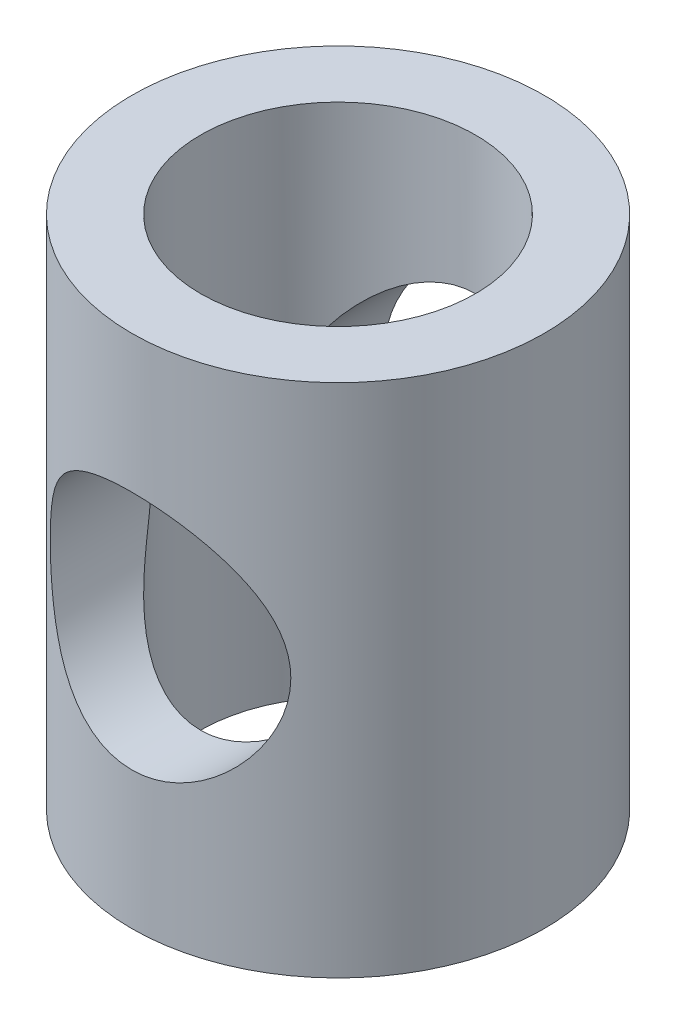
ISO-10303-21;
HEADER;
FILE_DESCRIPTION(('STEP AP214'),'2;1');
FILE_NAME('part.step','',(''),(''),'','','');
FILE_SCHEMA(('AUTOMOTIVE_DESIGN { 1 0 10303 214 1 1 1 1 }'));
ENDSEC;
DATA;
#1=APPLICATION_CONTEXT('core data for automotive mechanical design processes');
#2=APPLICATION_PROTOCOL_DEFINITION('international standard','automotive_design',2000,#1);
#3=PRODUCT_CONTEXT('',#1,'mechanical');
#4=PRODUCT('Part','Part','',(#3));
#5=PRODUCT_RELATED_PRODUCT_CATEGORY('part','',(#4));
#6=PRODUCT_DEFINITION_FORMATION('','',#4);
#7=PRODUCT_DEFINITION_CONTEXT('part definition',#1,'design');
#8=PRODUCT_DEFINITION('design','',#6,#7);
#9=PRODUCT_DEFINITION_SHAPE('','',#8);
#10=(LENGTH_UNIT() NAMED_UNIT(*) SI_UNIT(.MILLI.,.METRE.));
#11=(NAMED_UNIT(*) PLANE_ANGLE_UNIT() SI_UNIT($,.RADIAN.));
#12=(NAMED_UNIT(*) SI_UNIT($,.STERADIAN.) SOLID_ANGLE_UNIT());
#13=UNCERTAINTY_MEASURE_WITH_UNIT(LENGTH_MEASURE(1.E-05),#10,'distance_accuracy_value','');
#14=(GEOMETRIC_REPRESENTATION_CONTEXT(3) GLOBAL_UNCERTAINTY_ASSIGNED_CONTEXT((#13)) GLOBAL_UNIT_ASSIGNED_CONTEXT((#10,
#11,#12)) REPRESENTATION_CONTEXT('',''));
#15=CARTESIAN_POINT('',(0.,0.,0.));
#16=DIRECTION('',(0.,0.,1.));
#17=DIRECTION('',(1.,0.,0.));
#18=AXIS2_PLACEMENT_3D('',#15,#16,#17);
#19=CARTESIAN_POINT('',(0.,75.,0.));
#20=DIRECTION('',(0.,1.,0.));
#21=DIRECTION('',(0.,0.,1.));
#22=AXIS2_PLACEMENT_3D('',#19,#20,#21);
#23=PLANE('',#22);
#24=CARTESIAN_POINT('',(0.,75.,0.));
#25=DIRECTION('',(0.,1.,0.));
#26=DIRECTION('',(0.,0.,1.));
#27=AXIS2_PLACEMENT_3D('',#24,#25,#26);
#28=CIRCLE('',#27,30.);
#29=CARTESIAN_POINT('',(0.,75.,30.));
#30=VERTEX_POINT('',#29);
#31=EDGE_CURVE('E10',#30,#30,#28,.T.);
#32=ORIENTED_EDGE('',*,*,#31,.T.);
#33=EDGE_LOOP('',(#32));
#34=FACE_BOUND('',#33,.T.);
#35=CARTESIAN_POINT('',(0.,75.,0.));
#36=DIRECTION('',(0.,1.,0.));
#37=DIRECTION('',(0.,0.,1.));
#38=AXIS2_PLACEMENT_3D('',#35,#36,#37);
#39=CIRCLE('',#38,20.);
#40=CARTESIAN_POINT('',(0.,75.,20.));
#41=VERTEX_POINT('',#40);
#42=EDGE_CURVE('E46',#41,#41,#39,.T.);
#43=ORIENTED_EDGE('',*,*,#42,.F.);
#44=EDGE_LOOP('',(#43));
#45=FACE_BOUND('',#44,.T.);
#46=ADVANCED_FACE('F28',(#34,#45),#23,.T.);
#47=CARTESIAN_POINT('',(0.,0.,0.));
#48=DIRECTION('',(0.,1.,0.));
#49=DIRECTION('',(0.,0.,1.));
#50=AXIS2_PLACEMENT_3D('',#47,#48,#49);
#51=PLANE('',#50);
#52=CARTESIAN_POINT('',(0.,0.,0.));
#53=DIRECTION('',(0.,1.,0.));
#54=DIRECTION('',(0.,0.,1.));
#55=AXIS2_PLACEMENT_3D('',#52,#53,#54);
#56=CIRCLE('',#55,30.);
#57=CARTESIAN_POINT('',(0.,0.,30.));
#58=VERTEX_POINT('',#57);
#59=EDGE_CURVE('E41',#58,#58,#56,.T.);
#60=ORIENTED_EDGE('',*,*,#59,.F.);
#61=EDGE_LOOP('',(#60));
#62=FACE_BOUND('',#61,.T.);
#63=CARTESIAN_POINT('',(0.,0.,0.));
#64=DIRECTION('',(0.,1.,0.));
#65=DIRECTION('',(0.,0.,1.));
#66=AXIS2_PLACEMENT_3D('',#63,#64,#65);
#67=CIRCLE('',#66,20.);
#68=CARTESIAN_POINT('',(0.,0.,20.));
#69=VERTEX_POINT('',#68);
#70=EDGE_CURVE('E49',#69,#69,#67,.T.);
#71=ORIENTED_EDGE('',*,*,#70,.T.);
#72=EDGE_LOOP('',(#71));
#73=FACE_BOUND('',#72,.T.);
#74=ADVANCED_FACE('F82',(#62,#73),#51,.F.);
#75=CARTESIAN_POINT('',(0.,75.,0.));
#76=DIRECTION('',(0.,-1.,0.));
#77=DIRECTION('',(0.,0.,-1.));
#78=AXIS2_PLACEMENT_3D('',#75,#76,#77);
#79=CYLINDRICAL_SURFACE('',#78,30.);
#80=CARTESIAN_POINT('',(0.,55.,-30.));
#81=CARTESIAN_POINT('',(-0.449810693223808,54.9999968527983,-29.9999971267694));
#82=CARTESIAN_POINT('',(-0.899793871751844,54.9826284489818,-29.9898563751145));
#83=CARTESIAN_POINT('',(-1.79639765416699,54.9133677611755,-29.9495342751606));
#84=CARTESIAN_POINT('',(-2.24301575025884,54.861451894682,-29.919339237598));
#85=CARTESIAN_POINT('',(-3.13036631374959,54.7236137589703,-29.8395660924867));
#86=CARTESIAN_POINT('',(-3.57108144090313,54.6376074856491,-29.789940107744));
#87=CARTESIAN_POINT('',(-4.44222245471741,54.4327162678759,-29.6725435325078));
#88=CARTESIAN_POINT('',(-4.8726500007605,54.3138366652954,-29.6047758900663));
#89=CARTESIAN_POINT('',(-5.71841043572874,54.0452616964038,-29.453072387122));
#90=CARTESIAN_POINT('',(-6.13380743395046,53.8957215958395,-29.3692181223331));
#91=CARTESIAN_POINT('',(-6.94940208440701,53.5670205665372,-29.1869910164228));
#92=CARTESIAN_POINT('',(-7.34959917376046,53.3878585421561,-29.0886176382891));
#93=CARTESIAN_POINT('',(-8.13262843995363,53.0016401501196,-28.8794824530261));
#94=CARTESIAN_POINT('',(-8.51546940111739,52.7945981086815,-28.7687270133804));
#95=CARTESIAN_POINT('',(-9.26243782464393,52.3541334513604,-28.5369970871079));
#96=CARTESIAN_POINT('',(-9.62656342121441,52.1207082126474,-28.4160215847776));
#97=CARTESIAN_POINT('',(-10.3609767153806,51.6107946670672,-28.1569314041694));
#98=CARTESIAN_POINT('',(-10.7297256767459,51.3323977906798,-28.0182109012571));
#99=CARTESIAN_POINT('',(-11.4427112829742,50.7486479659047,-27.7346638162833));
#100=CARTESIAN_POINT('',(-11.7869468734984,50.4432938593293,-27.5898369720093));
#101=CARTESIAN_POINT('',(-12.4500740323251,49.8067916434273,-27.2970177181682));
#102=CARTESIAN_POINT('',(-12.7689355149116,49.4756138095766,-27.1490218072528));
#103=CARTESIAN_POINT('',(-13.3796980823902,48.7891441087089,-26.853283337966));
#104=CARTESIAN_POINT('',(-13.6715977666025,48.4338509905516,-26.7055407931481));
#105=CARTESIAN_POINT('',(-14.259039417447,47.6583817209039,-26.3970089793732));
#106=CARTESIAN_POINT('',(-14.5511698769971,47.2354348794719,-26.2366633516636));
#107=CARTESIAN_POINT('',(-15.0985250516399,46.3628336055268,-25.9255412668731));
#108=CARTESIAN_POINT('',(-15.3537441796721,45.9131751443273,-25.774766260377));
#109=CARTESIAN_POINT('',(-15.8247150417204,44.9897705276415,-25.4883167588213));
#110=CARTESIAN_POINT('',(-16.0405167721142,44.5160558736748,-25.3526232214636));
#111=CARTESIAN_POINT('',(-16.4304876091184,43.5466343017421,-25.1016518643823));
#112=CARTESIAN_POINT('',(-16.6046711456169,43.0509350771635,-24.9863669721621));
#113=CARTESIAN_POINT('',(-16.8738511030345,42.1570607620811,-24.8051015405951));
#114=CARTESIAN_POINT('',(-16.9778465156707,41.7626387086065,-24.7338784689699));
#115=CARTESIAN_POINT('',(-17.1584379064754,40.9648502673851,-24.6089435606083));
#116=CARTESIAN_POINT('',(-17.2350379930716,40.5614852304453,-24.5552290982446));
#117=CARTESIAN_POINT('',(-17.3597911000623,39.7486748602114,-24.4671923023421));
#118=CARTESIAN_POINT('',(-17.4079717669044,39.3392358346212,-24.4328511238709));
#119=CARTESIAN_POINT('',(-17.475309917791,38.5167506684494,-24.3847344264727));
#120=CARTESIAN_POINT('',(-17.4944668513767,38.103704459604,-24.3709592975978));
#121=CARTESIAN_POINT('',(-17.5034683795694,37.2764665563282,-24.3644952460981));
#122=CARTESIAN_POINT('',(-17.4932661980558,36.8622740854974,-24.37183997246));
#123=CARTESIAN_POINT('',(-17.4436068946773,36.036559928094,-24.4074066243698));
#124=CARTESIAN_POINT('',(-17.4041496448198,35.6250382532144,-24.4356286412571));
#125=CARTESIAN_POINT('',(-17.2965326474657,34.807396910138,-24.5119213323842));
#126=CARTESIAN_POINT('',(-17.2283554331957,34.4012806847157,-24.5600040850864));
#127=CARTESIAN_POINT('',(-17.0642171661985,33.597329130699,-24.674328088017));
#128=CARTESIAN_POINT('',(-16.9682554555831,33.1994939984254,-24.7405697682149));
#129=CARTESIAN_POINT('',(-16.7505223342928,32.4173277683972,-24.8884945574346));
#130=CARTESIAN_POINT('',(-16.6289547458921,32.0329164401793,-24.9700552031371));
#131=CARTESIAN_POINT('',(-16.3607241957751,31.2760150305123,-25.1466195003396));
#132=CARTESIAN_POINT('',(-16.2140530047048,30.9035289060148,-25.2416275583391));
#133=CARTESIAN_POINT('',(-15.8968063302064,30.1719347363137,-25.4426176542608));
#134=CARTESIAN_POINT('',(-15.7262290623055,29.8128276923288,-25.5486005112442));
#135=CARTESIAN_POINT('',(-15.3622772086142,29.1090885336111,-25.7690843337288));
#136=CARTESIAN_POINT('',(-15.1689014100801,28.7644571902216,-25.8835857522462));
#137=CARTESIAN_POINT('',(-14.7262927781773,28.0343979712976,-26.1383221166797));
#138=CARTESIAN_POINT('',(-14.4731215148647,27.651739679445,-26.2796660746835));
#139=CARTESIAN_POINT('',(-13.938566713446,26.9086915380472,-26.5670554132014));
#140=CARTESIAN_POINT('',(-13.6571880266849,26.5482978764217,-26.7130999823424));
#141=CARTESIAN_POINT('',(-13.0671312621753,25.8505791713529,-27.0066427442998));
#142=CARTESIAN_POINT('',(-12.758427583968,25.5132762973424,-27.1541421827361));
#143=CARTESIAN_POINT('',(-12.1151118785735,24.8634210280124,-27.4472042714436));
#144=CARTESIAN_POINT('',(-11.7804985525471,24.5508698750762,-27.5927668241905));
#145=CARTESIAN_POINT('',(-11.0433879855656,23.9147479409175,-27.8966228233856));
#146=CARTESIAN_POINT('',(-10.6376217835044,23.594632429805,-28.0542511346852));
#147=CARTESIAN_POINT('',(-9.79663499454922,22.9898586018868,-28.358878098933));
#148=CARTESIAN_POINT('',(-9.36141156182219,22.7052037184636,-28.5058757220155));
#149=CARTESIAN_POINT('',(-8.46396420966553,22.1741060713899,-28.7851006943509));
#150=CARTESIAN_POINT('',(-8.00175196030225,21.9276469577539,-28.9173343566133));
#151=CARTESIAN_POINT('',(-7.0530224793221,21.475616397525,-29.1632455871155));
#152=CARTESIAN_POINT('',(-6.56650828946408,21.2700398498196,-29.2769254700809));
#153=CARTESIAN_POINT('',(-5.60604764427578,20.914870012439,-29.4753513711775));
#154=CARTESIAN_POINT('',(-5.13344287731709,20.7624488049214,-29.5615255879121));
#155=CARTESIAN_POINT('',(-4.17372530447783,20.4977139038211,-29.7122175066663));
#156=CARTESIAN_POINT('',(-3.68661298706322,20.385398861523,-29.776735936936));
#157=CARTESIAN_POINT('',(-2.70250384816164,20.2026964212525,-29.8821207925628));
#158=CARTESIAN_POINT('',(-2.20551623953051,20.1322716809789,-29.9230082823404));
#159=CARTESIAN_POINT('',(-1.20593477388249,20.0343821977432,-29.9799298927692));
#160=CARTESIAN_POINT('',(-0.703341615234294,20.0069121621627,-29.9959670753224));
#161=CARTESIAN_POINT('',(0.238332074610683,19.9961187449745,-30.0022648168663));
#162=CARTESIAN_POINT('',(0.677343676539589,20.0076152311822,-29.9955500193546));
#163=CARTESIAN_POINT('',(1.55252162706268,20.0634898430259,-29.962999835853));
#164=CARTESIAN_POINT('',(1.98868826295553,20.10786459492,-29.9371664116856));
#165=CARTESIAN_POINT('',(2.85498146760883,20.2289147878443,-29.8670045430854));
#166=CARTESIAN_POINT('',(3.28510812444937,20.3055897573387,-29.8226763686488));
#167=CARTESIAN_POINT('',(4.13637468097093,20.490293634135,-29.7165677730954));
#168=CARTESIAN_POINT('',(4.55751432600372,20.5983234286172,-29.654786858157));
#169=CARTESIAN_POINT('',(5.38154043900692,20.8425461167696,-29.5162806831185));
#170=CARTESIAN_POINT('',(5.78461054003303,20.9782647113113,-29.439808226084));
#171=CARTESIAN_POINT('',(6.57727299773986,21.2775169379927,-29.2729147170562));
#172=CARTESIAN_POINT('',(6.96686567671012,21.441049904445,-29.1824939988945));
#173=CARTESIAN_POINT('',(7.73077402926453,21.794514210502,-28.989487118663));
#174=CARTESIAN_POINT('',(8.10508844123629,21.9844477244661,-28.8868999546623));
#175=CARTESIAN_POINT('',(8.83691529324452,22.3892807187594,-28.6714922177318));
#176=CARTESIAN_POINT('',(9.19442574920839,22.6041831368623,-28.5586704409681));
#177=CARTESIAN_POINT('',(9.92769762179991,23.0812082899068,-28.3126392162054));
#178=CARTESIAN_POINT('',(10.3014755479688,23.3459182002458,-28.1785305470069));
#179=CARTESIAN_POINT('',(11.0255438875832,23.9023567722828,-27.9031798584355));
#180=CARTESIAN_POINT('',(11.3758329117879,24.1940870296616,-27.7619374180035));
#181=CARTESIAN_POINT('',(12.0520590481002,24.8033385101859,-27.4751323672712));
#182=CARTESIAN_POINT('',(12.3779693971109,25.1208873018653,-27.3295652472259));
#183=CARTESIAN_POINT('',(13.0038744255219,25.780108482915,-27.0373548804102));
#184=CARTESIAN_POINT('',(13.3038683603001,26.1217815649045,-26.8907116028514));
#185=CARTESIAN_POINT('',(13.9110859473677,26.870283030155,-26.5821575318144));
#186=CARTESIAN_POINT('',(14.2148796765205,27.280015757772,-26.4205194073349));
#187=CARTESIAN_POINT('',(14.7867809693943,28.1265241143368,-26.1047476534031));
#188=CARTESIAN_POINT('',(15.0548831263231,28.5633038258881,-25.9506151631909));
#189=CARTESIAN_POINT('',(15.5530565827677,29.4615959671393,-25.6551405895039));
#190=CARTESIAN_POINT('',(15.7831652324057,29.9230835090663,-25.5137860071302));
#191=CARTESIAN_POINT('',(16.2032645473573,30.8688796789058,-25.2490774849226));
#192=CARTESIAN_POINT('',(16.3932675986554,31.3531812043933,-25.1257179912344));
#193=CARTESIAN_POINT('',(16.6942555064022,32.2350507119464,-24.9264319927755));
#194=CARTESIAN_POINT('',(16.8134449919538,32.6288185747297,-24.8460125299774));
#195=CARTESIAN_POINT('',(17.0243377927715,33.4266604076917,-24.7019890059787));
#196=CARTESIAN_POINT('',(17.1160449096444,33.8307329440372,-24.6383826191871));
#197=CARTESIAN_POINT('',(17.270761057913,34.6464167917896,-24.5301802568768));
#198=CARTESIAN_POINT('',(17.3338004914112,35.0580196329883,-24.4855641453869));
#199=CARTESIAN_POINT('',(17.430437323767,35.8863954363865,-24.4168669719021));
#200=CARTESIAN_POINT('',(17.4640343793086,36.3031684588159,-24.3927861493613));
#201=CARTESIAN_POINT('',(17.5013184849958,37.1398792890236,-24.3660499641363));
#202=CARTESIAN_POINT('',(17.5049242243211,37.559822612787,-24.3634528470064));
#203=CARTESIAN_POINT('',(17.4819549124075,38.398450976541,-24.3799394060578));
#204=CARTESIAN_POINT('',(17.4553797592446,38.8171360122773,-24.3990231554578));
#205=CARTESIAN_POINT('',(17.3724427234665,39.6502522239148,-24.4581439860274));
#206=CARTESIAN_POINT('',(17.3160652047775,40.0646810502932,-24.4981920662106));
#207=CARTESIAN_POINT('',(17.1743332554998,40.8861520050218,-24.5977590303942));
#208=CARTESIAN_POINT('',(17.0889784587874,41.2931940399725,-24.657278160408));
#209=CARTESIAN_POINT('',(16.8933493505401,42.0854422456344,-24.7916997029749));
#210=CARTESIAN_POINT('',(16.7838907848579,42.4709378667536,-24.8660925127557));
#211=CARTESIAN_POINT('',(16.5398304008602,43.2309127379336,-25.0290936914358));
#212=CARTESIAN_POINT('',(16.4052203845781,43.6053883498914,-25.11770669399));
#213=CARTESIAN_POINT('',(16.1120287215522,44.341754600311,-25.3067765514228));
#214=CARTESIAN_POINT('',(15.9534452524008,44.7036442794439,-25.407234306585));
#215=CARTESIAN_POINT('',(15.6134217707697,45.4136605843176,-25.6175920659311));
#216=CARTESIAN_POINT('',(15.4319806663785,45.7617865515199,-25.7274925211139));
#217=CARTESIAN_POINT('',(15.0174007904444,46.4962218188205,-25.9719887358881));
#218=CARTESIAN_POINT('',(14.780608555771,46.8800773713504,-26.1077707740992));
#219=CARTESIAN_POINT('',(14.2793303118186,47.6268432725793,-26.3852759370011));
#220=CARTESIAN_POINT('',(14.01484886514,47.9897570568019,-26.5269980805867));
#221=CARTESIAN_POINT('',(13.4591512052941,48.6938616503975,-26.8132242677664));
#222=CARTESIAN_POINT('',(13.1679135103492,49.0350346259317,-26.9577304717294));
#223=CARTESIAN_POINT('',(12.5600071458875,49.6941478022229,-27.2462739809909));
#224=CARTESIAN_POINT('',(12.2433370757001,50.0120867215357,-27.3903112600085));
#225=CARTESIAN_POINT('',(11.5394613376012,50.6663568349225,-27.6949046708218));
#226=CARTESIAN_POINT('',(11.1485939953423,50.9990058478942,-27.8549417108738));
#227=CARTESIAN_POINT('',(10.3368854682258,51.6302209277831,-28.1662522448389));
#228=CARTESIAN_POINT('',(9.91604087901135,51.9287831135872,-28.3175247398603));
#229=CARTESIAN_POINT('',(9.046247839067,52.4894358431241,-28.6072642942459));
#230=CARTESIAN_POINT('',(8.59728835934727,52.7515119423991,-28.7457262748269));
#231=CARTESIAN_POINT('',(7.67398823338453,53.2363172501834,-29.0058586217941));
#232=CARTESIAN_POINT('',(7.19965138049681,53.4590523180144,-29.1275314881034));
#233=CARTESIAN_POINT('',(6.25177433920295,53.8528613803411,-29.3451946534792));
#234=CARTESIAN_POINT('',(5.77926155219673,54.0258832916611,-29.4421287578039));
#235=CARTESIAN_POINT('',(4.81738564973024,54.3314407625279,-29.6147173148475));
#236=CARTESIAN_POINT('',(4.32801959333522,54.4639692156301,-29.6903680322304));
#237=CARTESIAN_POINT('',(3.3383898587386,54.6860844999,-29.8178345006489));
#238=CARTESIAN_POINT('',(2.83816928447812,54.7758169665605,-29.8697310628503));
#239=CARTESIAN_POINT('',(1.83015669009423,54.9114535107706,-29.948382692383));
#240=CARTESIAN_POINT('',(1.32237185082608,54.9573967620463,-29.975160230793));
#241=CARTESIAN_POINT('',(0.678004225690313,54.9873882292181,-29.9926448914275));
#242=CARTESIAN_POINT('',(0.542466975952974,54.9921161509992,-29.9954016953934));
#243=CARTESIAN_POINT('',(0.271291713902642,54.9984225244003,-29.9990796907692));
#244=CARTESIAN_POINT('',(0.135653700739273,55.0000009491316,-30.0000008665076));
#245=CARTESIAN_POINT('',(0.,55.,-30.));
#246=B_SPLINE_CURVE_WITH_KNOTS('',3,(#80,#81,#82,#83,#84,#85,#86,#87,#88,#89,#90,#91,#92,#93,
#94,#95,#96,#97,#98,#99,#100,#101,#102,#103,#104,#105,#106,#107,#108,#109,#110,#111,#112,#113,
#114,#115,#116,#117,#118,#119,#120,#121,#122,#123,#124,#125,#126,#127,#128,#129,#130,#131,#132,
#133,#134,#135,#136,#137,#138,#139,#140,#141,#142,#143,#144,#145,#146,#147,#148,#149,#150,#151,
#152,#153,#154,#155,#156,#157,#158,#159,#160,#161,#162,#163,#164,#165,#166,#167,#168,#169,#170,
#171,#172,#173,#174,#175,#176,#177,#178,#179,#180,#181,#182,#183,#184,#185,#186,#187,#188,#189,
#190,#191,#192,#193,#194,#195,#196,#197,#198,#199,#200,#201,#202,#203,#204,#205,#206,#207,#208,
#209,#210,#211,#212,#213,#214,#215,#216,#217,#218,#219,#220,#221,#222,#223,#224,#225,#226,#227,
#228,#229,#230,#231,#232,#233,#234,#235,#236,#237,#238,#239,#240,#241,#242,#243,#244,#245),
.UNSPECIFIED.,.T.,.F.,(4,2,2,2,2,2,2,2,2,2,2,2,2,2,2,2,2,2,2,2,2,2,2,2,2,2,2,2,2,2,2,2,2,2,2,2,
2,2,2,2,2,2,2,2,2,2,2,2,2,2,2,2,2,2,2,2,2,2,2,2,2,2,2,2,2,2,2,2,2,2,2,2,2,2,2,2,2,2,2,2,2,2,4),
(0.,1.3492851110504,2.69949220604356,4.05304731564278,5.4063826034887,6.75302671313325,
8.09972064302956,9.44572519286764,10.7918636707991,12.2376383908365,13.6834752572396,
15.1310016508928,16.5786032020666,18.1919933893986,19.8056275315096,21.4172005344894,
23.0282139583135,24.2691750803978,25.509950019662,26.7495159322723,27.9891053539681,
29.2306708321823,30.4722417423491,31.7145688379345,32.9569253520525,34.1897431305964,
35.4229658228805,36.6562806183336,37.8896610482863,39.3285368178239,40.7671655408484,
42.2071566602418,43.6472200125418,45.2661955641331,46.8853277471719,48.503764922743,
50.1220000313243,51.6318206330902,53.1415904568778,54.6500124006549,56.1582484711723,
57.474265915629,58.7901483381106,60.106011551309,61.4219120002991,62.7169231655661,
64.0119033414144,65.306990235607,66.6022296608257,68.0325140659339,69.462882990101,
70.8947998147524,72.3267577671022,73.9300541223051,75.5335930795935,77.1355461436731,
78.7370037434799,79.9933457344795,81.249513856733,82.5043466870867,83.7591941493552,
85.0174425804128,86.2756952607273,87.5346087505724,88.7935381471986,90.015062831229,
91.2369863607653,92.4590028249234,93.6810776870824,95.0927219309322,96.5041339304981,
97.9166891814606,99.3293222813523,100.940233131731,102.551327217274,104.163057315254,
105.774547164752,107.309672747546,108.845067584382,110.375199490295,111.903961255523,
112.310874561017,112.717791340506),.UNSPECIFIED.);
#247=CARTESIAN_POINT('',(0.,55.,-30.));
#248=VERTEX_POINT('',#247);
#249=EDGE_CURVE('E72',#248,#248,#246,.T.);
#250=ORIENTED_EDGE('',*,*,#249,.T.);
#251=EDGE_LOOP('',(#250));
#252=FACE_BOUND('',#251,.T.);
#253=CARTESIAN_POINT('',(17.5,37.5,24.3669858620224));
#254=CARTESIAN_POINT('',(17.5000000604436,37.056792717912,24.3669858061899));
#255=CARTESIAN_POINT('',(17.4831377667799,36.6135858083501,24.3791226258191));
#256=CARTESIAN_POINT('',(17.4159868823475,35.7310236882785,24.4271382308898));
#257=CARTESIAN_POINT('',(17.365697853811,35.2916685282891,24.4630173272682));
#258=CARTESIAN_POINT('',(17.2324735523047,34.4199918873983,24.5570452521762));
#259=CARTESIAN_POINT('',(17.1495094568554,33.9876769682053,24.615213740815));
#260=CARTESIAN_POINT('',(16.9521709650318,33.1335291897,24.7515300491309));
#261=CARTESIAN_POINT('',(16.8377956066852,32.711696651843,24.8296784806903));
#262=CARTESIAN_POINT('',(16.5800092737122,31.8839616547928,25.0025432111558));
#263=CARTESIAN_POINT('',(16.4368106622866,31.4779672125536,25.097137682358));
#264=CARTESIAN_POINT('',(16.122278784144,30.6804715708,25.3003393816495));
#265=CARTESIAN_POINT('',(15.9509327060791,30.2889770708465,25.4089529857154));
#266=CARTESIAN_POINT('',(15.581570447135,29.5221702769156,25.6371168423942));
#267=CARTESIAN_POINT('',(15.3835564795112,29.1468566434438,25.7566661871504));
#268=CARTESIAN_POINT('',(14.9621080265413,28.4135147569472,26.0037496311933));
#269=CARTESIAN_POINT('',(14.7386708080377,28.0554883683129,26.1312845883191));
#270=CARTESIAN_POINT('',(14.2404421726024,27.3176588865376,26.4064348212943));
#271=CARTESIAN_POINT('',(13.9626999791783,26.9400783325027,26.5546739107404));
#272=CARTESIAN_POINT('',(13.3784249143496,26.2089974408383,26.8537794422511));
#273=CARTESIAN_POINT('',(13.0718904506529,25.8554984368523,27.0046460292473));
#274=CARTESIAN_POINT('',(12.431089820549,25.1737277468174,27.3055555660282));
#275=CARTESIAN_POINT('',(12.0968058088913,24.8454725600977,27.4555979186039));
#276=CARTESIAN_POINT('',(11.401920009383,24.2159483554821,27.7513752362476));
#277=CARTESIAN_POINT('',(11.0413169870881,23.91468060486,27.8971099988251));
#278=CARTESIAN_POINT('',(10.2576361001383,23.312008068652,28.195279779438));
#279=CARTESIAN_POINT('',(9.83192059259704,23.0136257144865,28.3469187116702));
#280=CARTESIAN_POINT('',(8.95228757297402,22.4541287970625,28.6368818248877));
#281=CARTESIAN_POINT('',(8.4983676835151,22.1930173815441,28.7752048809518));
#282=CARTESIAN_POINT('',(7.56526903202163,21.7110089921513,29.0344792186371));
#283=CARTESIAN_POINT('',(7.08610713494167,21.4900855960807,29.1554419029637));
#284=CARTESIAN_POINT('',(6.1056098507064,21.0911142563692,29.3764178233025));
#285=CARTESIAN_POINT('',(5.60427787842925,20.9130597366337,29.4764342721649));
#286=CARTESIAN_POINT('',(4.63019809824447,20.616686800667,29.6442704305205));
#287=CARTESIAN_POINT('',(4.15901978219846,20.4943985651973,29.7141960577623));
#288=CARTESIAN_POINT('',(3.20545821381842,20.289165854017,29.8321259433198));
#289=CARTESIAN_POINT('',(2.72307558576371,20.2062191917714,29.8801314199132));
#290=CARTESIAN_POINT('',(1.75166695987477,20.0810068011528,29.9527749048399));
#291=CARTESIAN_POINT('',(1.26264607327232,20.038711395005,29.9774299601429));
#292=CARTESIAN_POINT('',(0.282176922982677,19.9953977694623,30.0026794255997));
#293=CARTESIAN_POINT('',(-0.209271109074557,19.9943756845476,30.0032760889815));
#294=CARTESIAN_POINT('',(-1.1322303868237,20.0312954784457,29.9817525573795));
#295=CARTESIAN_POINT('',(-1.56399587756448,20.0646709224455,29.9622946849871));
#296=CARTESIAN_POINT('',(-2.42263724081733,20.1631166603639,29.9051151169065));
#297=CARTESIAN_POINT('',(-2.8495135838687,20.2281838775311,29.8673951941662));
#298=CARTESIAN_POINT('',(-3.6954666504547,20.389215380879,29.7745634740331));
#299=CARTESIAN_POINT('',(-4.11454310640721,20.4851807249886,29.7194510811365));
#300=CARTESIAN_POINT('',(-4.94223813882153,20.7069102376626,29.5930662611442));
#301=CARTESIAN_POINT('',(-5.35085629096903,20.832675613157,29.5217931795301));
#302=CARTESIAN_POINT('',(-6.15833772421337,21.1137547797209,29.3640154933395));
#303=CARTESIAN_POINT('',(-6.55710361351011,21.2692852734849,29.2773995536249));
#304=CARTESIAN_POINT('',(-7.33960770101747,21.6078036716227,29.0910972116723));
#305=CARTESIAN_POINT('',(-7.72334601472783,21.7907913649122,28.9914109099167));
#306=CARTESIAN_POINT('',(-8.4741739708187,22.1827627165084,28.780903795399));
#307=CARTESIAN_POINT('',(-8.84126121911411,22.3917500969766,28.67008138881));
#308=CARTESIAN_POINT('',(-9.55736888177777,22.8342610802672,28.4393785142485));
#309=CARTESIAN_POINT('',(-9.90638747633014,23.0677871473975,28.3194971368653));
#310=CARTESIAN_POINT('',(-10.6244969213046,23.5863994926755,28.0585529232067));
#311=CARTESIAN_POINT('',(-10.9912325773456,23.8743249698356,27.9166447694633));
#312=CARTESIAN_POINT('',(-11.6993773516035,24.4772938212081,27.6273577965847));
#313=CARTESIAN_POINT('',(-12.0407847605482,24.7923390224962,27.4799786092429));
#314=CARTESIAN_POINT('',(-12.6974279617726,25.4484034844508,27.1828134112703));
#315=CARTESIAN_POINT('',(-13.0126317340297,25.7894535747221,27.0330247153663));
#316=CARTESIAN_POINT('',(-13.6151935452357,26.4958172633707,26.7346135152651));
#317=CARTESIAN_POINT('',(-13.9025503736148,26.861131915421,26.5859910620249));
#318=CARTESIAN_POINT('',(-14.4771819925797,27.6548928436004,26.2779084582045));
#319=CARTESIAN_POINT('',(-14.7611902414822,28.0859194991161,26.1189793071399));
#320=CARTESIAN_POINT('',(-15.2915507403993,28.9743826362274,25.8120591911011));
#321=CARTESIAN_POINT('',(-15.5378973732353,29.431823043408,25.6640698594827));
#322=CARTESIAN_POINT('',(-15.9902353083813,30.3702543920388,25.3846994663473));
#323=CARTESIAN_POINT('',(-16.1962862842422,30.8512091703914,25.2532939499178));
#324=CARTESIAN_POINT('',(-16.5658392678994,31.8344443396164,25.0124312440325));
#325=CARTESIAN_POINT('',(-16.7293569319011,32.3367168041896,24.9029659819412));
#326=CARTESIAN_POINT('',(-16.9778218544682,33.2376897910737,24.7339935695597));
#327=CARTESIAN_POINT('',(-17.0722055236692,33.6327435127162,24.6687946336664));
#328=CARTESIAN_POINT('',(-17.2335829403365,34.4309117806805,24.556329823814));
#329=CARTESIAN_POINT('',(-17.3005809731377,34.8340250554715,24.5090611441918));
#330=CARTESIAN_POINT('',(-17.4062542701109,35.6454011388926,24.4341261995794));
#331=CARTESIAN_POINT('',(-17.4449545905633,36.0536590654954,24.4064425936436));
#332=CARTESIAN_POINT('',(-17.4935678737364,36.8727816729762,24.371622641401));
#333=CARTESIAN_POINT('',(-17.5034801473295,37.2836464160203,24.3644867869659));
#334=CARTESIAN_POINT('',(-17.494359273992,38.1052442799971,24.3710365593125));
#335=CARTESIAN_POINT('',(-17.4753008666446,38.515976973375,24.384740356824));
#336=CARTESIAN_POINT('',(-17.4084809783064,39.3338939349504,24.4324877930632));
#337=CARTESIAN_POINT('',(-17.3607193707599,39.7410781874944,24.466531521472));
#338=CARTESIAN_POINT('',(-17.2371360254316,40.5493284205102,24.5537540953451));
#339=CARTESIAN_POINT('',(-17.1612964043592,40.9503903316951,24.606945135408));
#340=CARTESIAN_POINT('',(-16.9825350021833,41.7436838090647,24.730654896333));
#341=CARTESIAN_POINT('',(-16.8796124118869,42.1359151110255,24.801174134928));
#342=CARTESIAN_POINT('',(-16.6470304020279,42.9121807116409,24.9578875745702));
#343=CARTESIAN_POINT('',(-16.5171914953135,43.2961398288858,25.0441865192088));
#344=CARTESIAN_POINT('',(-16.2323818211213,44.0515501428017,25.229717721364));
#345=CARTESIAN_POINT('',(-16.0774008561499,44.4229961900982,25.3289552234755));
#346=CARTESIAN_POINT('',(-15.7435235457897,45.15194018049,25.5378194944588));
#347=CARTESIAN_POINT('',(-15.5646265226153,45.5094377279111,25.647446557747));
#348=CARTESIAN_POINT('',(-15.1840021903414,46.2094687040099,25.8746053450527));
#349=CARTESIAN_POINT('',(-14.9822722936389,46.5520004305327,25.992137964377));
#350=CARTESIAN_POINT('',(-14.5202953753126,47.2789095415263,26.2534385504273));
#351=CARTESIAN_POINT('',(-14.2559555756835,47.6603218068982,26.39823646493));
#352=CARTESIAN_POINT('',(-13.6986524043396,48.4000650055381,26.6916862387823));
#353=CARTESIAN_POINT('',(-13.4056864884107,48.7583938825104,26.8403384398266));
#354=CARTESIAN_POINT('',(-12.7921419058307,49.450953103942,27.1381182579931));
#355=CARTESIAN_POINT('',(-12.4715408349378,49.7851634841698,27.2872461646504));
#356=CARTESIAN_POINT('',(-11.8041332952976,50.4277626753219,27.5825237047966));
#357=CARTESIAN_POINT('',(-11.4573256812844,50.7361503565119,27.7286732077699));
#358=CARTESIAN_POINT('',(-10.6984420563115,51.3585845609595,28.0308445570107));
#359=CARTESIAN_POINT('',(-10.2834072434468,51.6693918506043,28.1861371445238));
#360=CARTESIAN_POINT('',(-9.42437405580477,52.2547046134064,28.4848726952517));
#361=CARTESIAN_POINT('',(-8.98037302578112,52.5292067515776,28.628314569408));
#362=CARTESIAN_POINT('',(-8.06608814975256,53.0390473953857,28.899228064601));
#363=CARTESIAN_POINT('',(-7.59581924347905,53.2744078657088,29.0267086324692));
#364=CARTESIAN_POINT('',(-6.6318554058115,53.7032917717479,29.2619975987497));
#365=CARTESIAN_POINT('',(-6.13816373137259,53.8968210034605,29.3698087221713));
#366=CARTESIAN_POINT('',(-5.17068943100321,54.2258536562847,29.554816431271));
#367=CARTESIAN_POINT('',(-4.6983821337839,54.364717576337,29.6337509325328));
#368=CARTESIAN_POINT('',(-3.74074104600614,54.6026373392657,29.7697944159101));
#369=CARTESIAN_POINT('',(-3.25540782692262,54.7016949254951,29.8269043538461));
#370=CARTESIAN_POINT('',(-2.27632374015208,54.8583968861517,29.9175510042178));
#371=CARTESIAN_POINT('',(-1.78258009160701,54.9160751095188,29.9511069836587));
#372=CARTESIAN_POINT('',(-0.790940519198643,54.9891822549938,29.9936758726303));
#373=CARTESIAN_POINT('',(-0.293045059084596,55.0046158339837,30.0026914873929));
#374=CARTESIAN_POINT('',(0.640488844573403,54.9937132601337,29.9963337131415));
#375=CARTESIAN_POINT('',(1.07621468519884,54.9723048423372,29.9838375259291));
#376=CARTESIAN_POINT('',(1.9438839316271,54.8971517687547,29.9401059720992));
#377=CARTESIAN_POINT('',(2.37582771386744,54.8434103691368,29.9088724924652));
#378=CARTESIAN_POINT('',(3.23286747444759,54.704274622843,29.8284068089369));
#379=CARTESIAN_POINT('',(3.65796338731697,54.6188799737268,29.7791744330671));
#380=CARTESIAN_POINT('',(4.4984918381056,54.4174570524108,29.6638422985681));
#381=CARTESIAN_POINT('',(4.91392404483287,54.3014277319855,29.5977419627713));
#382=CARTESIAN_POINT('',(5.73041444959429,54.0407087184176,29.4505269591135));
#383=CARTESIAN_POINT('',(6.13153763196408,53.8961756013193,29.3694944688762));
#384=CARTESIAN_POINT('',(6.91961449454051,53.5794680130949,29.1938680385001));
#385=CARTESIAN_POINT('',(7.30656841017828,53.4072940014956,29.0992743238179));
#386=CARTESIAN_POINT('',(8.06459215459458,53.0367423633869,28.8983758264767));
#387=CARTESIAN_POINT('',(8.43566012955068,52.8383616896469,28.7920696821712));
#388=CARTESIAN_POINT('',(9.16043189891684,52.4168452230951,28.5697429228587));
#389=CARTESIAN_POINT('',(9.5141339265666,52.1937069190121,28.4537213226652));
#390=CARTESIAN_POINT('',(10.2407719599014,51.6982606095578,28.2008927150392));
#391=CARTESIAN_POINT('',(10.6115554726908,51.4232439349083,28.0632022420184));
#392=CARTESIAN_POINT('',(11.3288211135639,50.846150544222,27.7814024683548));
#393=CARTESIAN_POINT('',(11.675301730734,50.5440721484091,27.6372927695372));
#394=CARTESIAN_POINT('',(12.3430975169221,49.9140601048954,27.3455818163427));
#395=CARTESIAN_POINT('',(12.6643847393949,49.5860985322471,27.1979769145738));
#396=CARTESIAN_POINT('',(13.2802074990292,48.905988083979,26.9026527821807));
#397=CARTESIAN_POINT('',(13.5747417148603,48.5538380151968,26.7549335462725));
#398=CARTESIAN_POINT('',(14.1679296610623,47.7850218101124,26.4460578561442));
#399=CARTESIAN_POINT('',(14.4632062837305,47.3655821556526,26.2852954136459));
#400=CARTESIAN_POINT('',(15.0171807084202,46.4999096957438,25.9727832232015));
#401=CARTESIAN_POINT('',(15.2758735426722,46.0536732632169,25.8210347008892));
#402=CARTESIAN_POINT('',(15.7542372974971,45.1368246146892,25.5319809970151));
#403=CARTESIAN_POINT('',(15.9739459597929,44.6662365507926,25.3946618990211));
#404=CARTESIAN_POINT('',(16.3721323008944,43.7028031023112,25.1397938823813));
#405=CARTESIAN_POINT('',(16.5506211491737,43.2099637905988,25.0222396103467));
#406=CARTESIAN_POINT('',(16.8367766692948,42.2919343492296,24.8303703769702));
#407=CARTESIAN_POINT('',(16.9513469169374,41.8697167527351,24.7520952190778));
#408=CARTESIAN_POINT('',(17.1490120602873,41.0147944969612,24.6155613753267));
#409=CARTESIAN_POINT('',(17.2321110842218,40.5820912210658,24.5573000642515));
#410=CARTESIAN_POINT('',(17.3655248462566,39.7097504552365,24.4631404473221));
#411=CARTESIAN_POINT('',(17.4158778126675,39.270121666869,24.4272160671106));
#412=CARTESIAN_POINT('',(17.4831154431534,38.386995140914,24.3791387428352));
#413=CARTESIAN_POINT('',(17.4999999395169,37.9434973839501,24.3669859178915));
#414=CARTESIAN_POINT('',(17.5,37.5,24.3669858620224));
#415=B_SPLINE_CURVE_WITH_KNOTS('',3,(#253,#254,#255,#256,#257,#258,#259,#260,#261,#262,#263,
#264,#265,#266,#267,#268,#269,#270,#271,#272,#273,#274,#275,#276,#277,#278,#279,#280,#281,#282,
#283,#284,#285,#286,#287,#288,#289,#290,#291,#292,#293,#294,#295,#296,#297,#298,#299,#300,#301,
#302,#303,#304,#305,#306,#307,#308,#309,#310,#311,#312,#313,#314,#315,#316,#317,#318,#319,#320,
#321,#322,#323,#324,#325,#326,#327,#328,#329,#330,#331,#332,#333,#334,#335,#336,#337,#338,#339,
#340,#341,#342,#343,#344,#345,#346,#347,#348,#349,#350,#351,#352,#353,#354,#355,#356,#357,#358,
#359,#360,#361,#362,#363,#364,#365,#366,#367,#368,#369,#370,#371,#372,#373,#374,#375,#376,#377,
#378,#379,#380,#381,#382,#383,#384,#385,#386,#387,#388,#389,#390,#391,#392,#393,#394,#395,#396,
#397,#398,#399,#400,#401,#402,#403,#404,#405,#406,#407,#408,#409,#410,#411,#412,#413,#414),
.UNSPECIFIED.,.T.,.F.,(4,2,2,2,2,2,2,2,2,2,2,2,2,2,2,2,2,2,2,2,2,2,2,2,2,2,2,2,2,2,2,2,2,2,2,2,
2,2,2,2,2,2,2,2,2,2,2,2,2,2,2,2,2,2,2,2,2,2,2,2,2,2,2,2,2,2,2,2,2,2,2,2,2,2,2,2,2,2,2,2,4),(0.,
1.32914158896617,2.65830058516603,3.98863465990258,5.31900948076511,6.63991934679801,
7.96143210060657,9.28283524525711,10.6043805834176,12.0777280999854,13.5511571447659,
15.0255411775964,16.4999944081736,18.1224671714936,19.7450768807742,21.3666158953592,
22.987906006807,24.4611651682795,25.9343424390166,27.4064433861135,28.8784064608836,
30.1773271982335,31.4761218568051,32.7749609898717,34.0738527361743,35.3825878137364,
36.6913128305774,38.0002254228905,39.3092695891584,40.769887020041,42.2306029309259,
43.6930783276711,45.1556172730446,46.7738815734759,48.3923870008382,50.0084771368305,
51.623971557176,52.8568196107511,54.0894746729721,55.3210369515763,56.5526287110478,
57.7852949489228,59.0179666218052,60.2514247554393,61.4849197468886,62.7269211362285,
63.9694275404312,65.2119691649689,66.4546517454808,67.9115510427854,69.368579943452,
70.8268013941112,72.2850866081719,73.9068057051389,75.5286736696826,77.1496284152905,
78.7703584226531,80.2639755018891,81.7575271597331,83.2498556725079,84.7420196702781,
86.0497217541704,87.3572921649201,88.6648750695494,89.9725027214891,91.2731379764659,
92.5737516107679,93.8745166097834,95.1754136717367,96.6191523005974,98.0629806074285,
99.5083885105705,100.953867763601,102.564565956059,104.175482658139,105.784831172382,
107.393743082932,108.725480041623,110.0570422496,111.387047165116,112.717058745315),.UNSPECIFIED.);
#416=CARTESIAN_POINT('',(17.5,37.5,24.3669858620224));
#417=VERTEX_POINT('',#416);
#418=EDGE_CURVE('E68',#417,#417,#415,.T.);
#419=ORIENTED_EDGE('',*,*,#418,.T.);
#420=EDGE_LOOP('',(#419));
#421=FACE_BOUND('',#420,.T.);
#422=ORIENTED_EDGE('',*,*,#31,.F.);
#423=EDGE_LOOP('',(#422));
#424=FACE_BOUND('',#423,.T.);
#425=ORIENTED_EDGE('',*,*,#59,.T.);
#426=EDGE_LOOP('',(#425));
#427=FACE_BOUND('',#426,.T.);
#428=ADVANCED_FACE('F30',(#252,#421,#424,#427),#79,.T.);
#429=CARTESIAN_POINT('',(0.,75.,0.));
#430=DIRECTION('',(0.,-1.,0.));
#431=DIRECTION('',(0.,0.,-1.));
#432=AXIS2_PLACEMENT_3D('',#429,#430,#431);
#433=CYLINDRICAL_SURFACE('',#432,20.);
#434=CARTESIAN_POINT('',(0.,55.,-20.));
#435=CARTESIAN_POINT('',(-0.409310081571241,55.0000043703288,-20.0000043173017));
#436=CARTESIAN_POINT('',(-0.81857181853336,54.9856188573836,-19.9874130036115));
#437=CARTESIAN_POINT('',(-1.63371360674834,54.928365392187,-19.9373449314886));
#438=CARTESIAN_POINT('',(-2.03959248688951,54.8854879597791,-19.8998598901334));
#439=CARTESIAN_POINT('',(-2.84495519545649,54.7719959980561,-19.8007848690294));
#440=CARTESIAN_POINT('',(-3.24443051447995,54.7013473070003,-19.739165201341));
#441=CARTESIAN_POINT('',(-4.03348452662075,54.5336049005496,-19.5931618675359));
#442=CARTESIAN_POINT('',(-4.42306380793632,54.4365127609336,-19.5087795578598));
#443=CARTESIAN_POINT('',(-5.18734779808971,54.2182045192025,-19.3195605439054));
#444=CARTESIAN_POINT('',(-5.5621332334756,54.0971506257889,-19.2148614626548));
#445=CARTESIAN_POINT('',(-6.29757814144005,53.8322776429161,-18.9865422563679));
#446=CARTESIAN_POINT('',(-6.6582377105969,53.688458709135,-18.8629222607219));
#447=CARTESIAN_POINT('',(-7.36399894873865,53.3798571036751,-18.5987498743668));
#448=CARTESIAN_POINT('',(-7.70910095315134,53.215074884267,-18.4581978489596));
#449=CARTESIAN_POINT('',(-8.38281370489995,52.8662745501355,-18.1621555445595));
#450=CARTESIAN_POINT('',(-8.71142079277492,52.6822521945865,-18.0066619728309));
#451=CARTESIAN_POINT('',(-9.47545139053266,52.221904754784,-17.6199703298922));
#452=CARTESIAN_POINT('',(-9.90295999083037,51.9374321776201,-17.3827741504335));
#453=CARTESIAN_POINT('',(-10.7241338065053,51.3384055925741,-16.8885404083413));
#454=CARTESIAN_POINT('',(-11.1177867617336,51.0238407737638,-16.6314957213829));
#455=CARTESIAN_POINT('',(-11.8718925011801,50.3669653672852,-16.101891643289));
#456=CARTESIAN_POINT('',(-12.2322661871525,50.0245921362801,-15.8292976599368));
#457=CARTESIAN_POINT('',(-12.9189520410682,49.3150097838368,-15.2740176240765));
#458=CARTESIAN_POINT('',(-13.245268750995,48.9478039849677,-14.9913329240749));
#459=CARTESIAN_POINT('',(-13.8709259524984,48.1816356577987,-14.4146539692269));
#460=CARTESIAN_POINT('',(-14.1695316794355,47.7821585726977,-14.1205473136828));
#461=CARTESIAN_POINT('',(-14.7319137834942,46.9588254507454,-13.532778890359));
#462=CARTESIAN_POINT('',(-14.9956791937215,46.5349617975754,-13.2391172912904));
#463=CARTESIAN_POINT('',(-15.4875688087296,45.6630494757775,-12.6601412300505));
#464=CARTESIAN_POINT('',(-15.7157616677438,45.2150496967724,-12.3748115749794));
#465=CARTESIAN_POINT('',(-16.1360267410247,44.2923130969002,-11.8215430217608));
#466=CARTESIAN_POINT('',(-16.3281264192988,43.8175969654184,-11.5535910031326));
#467=CARTESIAN_POINT('',(-16.5900333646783,43.0760316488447,-11.171205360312));
#468=CARTESIAN_POINT('',(-16.6739706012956,42.8200131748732,-11.0453363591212));
#469=CARTESIAN_POINT('',(-16.8311299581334,42.2996823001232,-10.8043372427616));
#470=CARTESIAN_POINT('',(-16.9043516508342,42.0353695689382,-10.6892075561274));
#471=CARTESIAN_POINT('',(-17.03927411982,41.4986956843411,-10.4727930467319));
#472=CARTESIAN_POINT('',(-17.1009917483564,41.2263469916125,-10.37148803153));
#473=CARTESIAN_POINT('',(-17.2121601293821,40.6734796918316,-10.1859341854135));
#474=CARTESIAN_POINT('',(-17.2616155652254,40.392964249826,-10.1016788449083));
#475=CARTESIAN_POINT('',(-17.3407113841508,39.868302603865,-9.96518782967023));
#476=CARTESIAN_POINT('',(-17.3722302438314,39.6252065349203,-9.91001953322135));
#477=CARTESIAN_POINT('',(-17.425218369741,39.1347894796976,-9.81655062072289));
#478=CARTESIAN_POINT('',(-17.4466926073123,38.8874706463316,-9.7782416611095));
#479=CARTESIAN_POINT('',(-17.4791148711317,38.3902413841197,-9.72016781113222));
#480=CARTESIAN_POINT('',(-17.4900749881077,38.1403342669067,-9.70038162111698));
#481=CARTESIAN_POINT('',(-17.5012364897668,37.6394869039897,-9.68023037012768));
#482=CARTESIAN_POINT('',(-17.5014379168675,37.3885466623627,-9.67986523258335));
#483=CARTESIAN_POINT('',(-17.4910766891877,36.8876290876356,-9.69857437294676));
#484=CARTESIAN_POINT('',(-17.4805141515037,36.6376517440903,-9.71764843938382));
#485=CARTESIAN_POINT('',(-17.448891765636,36.140501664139,-9.77431406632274));
#486=CARTESIAN_POINT('',(-17.427831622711,35.8933290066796,-9.81190614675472));
#487=CARTESIAN_POINT('',(-17.3756436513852,35.40287442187,-9.90402925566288));
#488=CARTESIAN_POINT('',(-17.344500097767,35.1595991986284,-9.95858673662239));
#489=CARTESIAN_POINT('',(-17.2727255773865,34.6782610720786,-10.0825630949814));
#490=CARTESIAN_POINT('',(-17.2320912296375,34.440200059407,-10.1519872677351));
#491=CARTESIAN_POINT('',(-17.1147438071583,33.8281025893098,-10.3491760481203));
#492=CARTESIAN_POINT('',(-17.0310468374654,33.4585938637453,-10.486883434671));
#493=CARTESIAN_POINT('',(-16.8429306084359,32.7349509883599,-10.786425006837));
#494=CARTESIAN_POINT('',(-16.7384974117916,32.3808273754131,-10.9482754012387));
#495=CARTESIAN_POINT('',(-16.5101165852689,31.686210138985,-11.2897476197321));
#496=CARTESIAN_POINT('',(-16.3861020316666,31.3457684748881,-11.4694295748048));
#497=CARTESIAN_POINT('',(-16.1198996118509,30.6788757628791,-11.8406510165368));
#498=CARTESIAN_POINT('',(-15.9777136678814,30.352423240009,-12.0321892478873));
#499=CARTESIAN_POINT('',(-15.7054064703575,29.7752962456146,-12.3846537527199));
#500=CARTESIAN_POINT('',(-15.578385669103,29.5223137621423,-12.5442188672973));
#501=CARTESIAN_POINT('',(-15.3131866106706,29.0243959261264,-12.8666205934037));
#502=CARTESIAN_POINT('',(-15.1750072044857,28.7794614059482,-13.0294575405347));
#503=CARTESIAN_POINT('',(-14.7437691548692,28.0561244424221,-13.5207600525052));
#504=CARTESIAN_POINT('',(-14.4340769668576,27.5893284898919,-13.8519299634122));
#505=CARTESIAN_POINT('',(-13.7709397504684,26.6868438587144,-14.5113743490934));
#506=CARTESIAN_POINT('',(-13.4175392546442,26.2511242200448,-14.8396514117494));
#507=CARTESIAN_POINT('',(-12.66635234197,25.4115537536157,-15.4857603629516));
#508=CARTESIAN_POINT('',(-12.2685859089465,25.0076887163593,-15.8035968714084));
#509=CARTESIAN_POINT('',(-11.5236983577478,24.3224054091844,-16.3513589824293));
#510=CARTESIAN_POINT('',(-11.1855959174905,24.0340112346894,-16.5848544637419));
#511=CARTESIAN_POINT('',(-10.4825372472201,23.4797739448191,-17.0379355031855));
#512=CARTESIAN_POINT('',(-10.1175816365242,23.2139303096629,-17.2575213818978));
#513=CARTESIAN_POINT('',(-9.36167408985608,22.7075794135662,-17.6789723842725));
#514=CARTESIAN_POINT('',(-8.97075936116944,22.4670371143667,-17.8808619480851));
#515=CARTESIAN_POINT('',(-8.16333251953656,22.013741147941,-18.2636105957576));
#516=CARTESIAN_POINT('',(-7.74682568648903,21.8009817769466,-18.4444739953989));
#517=CARTESIAN_POINT('',(-6.97073127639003,21.443681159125,-18.749625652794));
#518=CARTESIAN_POINT('',(-6.61524010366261,21.293843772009,-18.8781487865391));
#519=CARTESIAN_POINT('',(-5.88978506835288,21.0163360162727,-19.1169080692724));
#520=CARTESIAN_POINT('',(-5.51982420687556,20.8886610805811,-19.2271479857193));
#521=CARTESIAN_POINT('',(-4.76726960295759,20.6572554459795,-19.4274209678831));
#522=CARTESIAN_POINT('',(-4.3846801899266,20.5535166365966,-19.5174608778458));
#523=CARTESIAN_POINT('',(-3.60900842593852,20.3715520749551,-19.6756627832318));
#524=CARTESIAN_POINT('',(-3.21592595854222,20.29332660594,-19.7438245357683));
#525=CARTESIAN_POINT('',(-2.4198710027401,20.1633991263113,-19.8571577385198));
#526=CARTESIAN_POINT('',(-2.016856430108,20.1118433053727,-19.9022024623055));
#527=CARTESIAN_POINT('',(-1.2062187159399,20.0368757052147,-19.9677334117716));
#528=CARTESIAN_POINT('',(-0.7985955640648,20.0134639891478,-19.988219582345));
#529=CARTESIAN_POINT('',(0.0177076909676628,19.9952483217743,-20.0041573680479));
#530=CARTESIAN_POINT('',(0.426387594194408,20.0004393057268,-19.9996134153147));
#531=CARTESIAN_POINT('',(1.24132609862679,20.0393156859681,-19.9656056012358));
#532=CARTESIAN_POINT('',(1.64758483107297,20.0729995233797,-19.9361431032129));
#533=CARTESIAN_POINT('',(2.41934317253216,20.1640701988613,-19.8565863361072));
#534=CARTESIAN_POINT('',(2.7853269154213,20.2191528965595,-19.8084987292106));
#535=CARTESIAN_POINT('',(3.51008378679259,20.3516762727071,-19.6929924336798));
#536=CARTESIAN_POINT('',(3.86885742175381,20.429115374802,-19.6255751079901));
#537=CARTESIAN_POINT('',(4.57722430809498,20.6052593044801,-19.4725540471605));
#538=CARTESIAN_POINT('',(4.92681597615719,20.7039677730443,-19.3869471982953));
#539=CARTESIAN_POINT('',(5.61507990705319,20.9213647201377,-19.1989107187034));
#540=CARTESIAN_POINT('',(5.95375149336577,21.0400544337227,-19.0964800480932));
#541=CARTESIAN_POINT('',(6.64099831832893,21.3045808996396,-18.8689360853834));
#542=CARTESIAN_POINT('',(6.98872904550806,21.4516997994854,-18.7427659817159));
#543=CARTESIAN_POINT('',(7.66901492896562,21.7654346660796,-18.4748446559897));
#544=CARTESIAN_POINT('',(8.00156984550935,21.9320509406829,-18.3330931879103));
#545=CARTESIAN_POINT('',(8.65064537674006,22.2831520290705,-18.0359008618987));
#546=CARTESIAN_POINT('',(8.96716818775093,22.467634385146,-17.8804618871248));
#547=CARTESIAN_POINT('',(9.58375657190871,22.8530261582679,-17.5576982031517));
#548=CARTESIAN_POINT('',(9.88381872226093,23.0539389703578,-17.3903710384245));
#549=CARTESIAN_POINT('',(10.6172602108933,23.5781253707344,-16.9569151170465));
#550=CARTESIAN_POINT('',(11.0398316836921,23.911184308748,-16.6842336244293));
#551=CARTESIAN_POINT('',(11.8463443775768,24.6082011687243,-16.1216034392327));
#552=CARTESIAN_POINT('',(12.2302679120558,24.9721730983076,-15.8316469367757));
#553=CARTESIAN_POINT('',(12.9614454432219,25.7301400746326,-15.2388790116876));
#554=CARTESIAN_POINT('',(13.3085076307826,26.1242753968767,-14.936010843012));
#555=CARTESIAN_POINT('',(13.9640591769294,26.9392914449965,-14.3250058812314));
#556=CARTESIAN_POINT('',(14.27255791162,27.3601656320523,-14.0168703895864));
#557=CARTESIAN_POINT('',(14.8580392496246,28.2385854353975,-13.3949589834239));
#558=CARTESIAN_POINT('',(15.134130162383,28.696753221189,-13.0812170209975));
#559=CARTESIAN_POINT('',(15.5179948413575,29.4059237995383,-12.6187236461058));
#560=CARTESIAN_POINT('',(15.6409672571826,29.6461134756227,-12.4658257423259));
#561=CARTESIAN_POINT('',(15.876607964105,30.1340819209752,-12.1642869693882));
#562=CARTESIAN_POINT('',(15.989277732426,30.3818595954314,-12.0156454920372));
#563=CARTESIAN_POINT('',(16.2033681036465,30.8837471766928,-11.7253223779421));
#564=CARTESIAN_POINT('',(16.3048577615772,31.1378047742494,-11.5836014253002));
#565=CARTESIAN_POINT('',(16.4970763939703,31.6542832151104,-11.3081681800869));
#566=CARTESIAN_POINT('',(16.5878039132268,31.9167051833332,-11.1744569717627));
#567=CARTESIAN_POINT('',(16.7577981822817,32.4498183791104,-10.9178679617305));
#568=CARTESIAN_POINT('',(16.8370854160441,32.7204937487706,-10.7949709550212));
#569=CARTESIAN_POINT('',(16.9836515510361,33.2707465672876,-10.5628789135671));
#570=CARTESIAN_POINT('',(17.050935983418,33.5503198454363,-10.4536775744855));
#571=CARTESIAN_POINT('',(17.1642334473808,34.0792127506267,-10.266419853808));
#572=CARTESIAN_POINT('',(17.2119003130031,34.3273875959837,-10.1861451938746));
#573=CARTESIAN_POINT('',(17.2969865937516,34.8299482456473,-10.040983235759));
#574=CARTESIAN_POINT('',(17.3344071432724,35.0843333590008,-9.9760942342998));
#575=CARTESIAN_POINT('',(17.3982168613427,35.5977006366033,-9.86439037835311));
#576=CARTESIAN_POINT('',(17.4246365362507,35.8566679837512,-9.81752556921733));
#577=CARTESIAN_POINT('',(17.465978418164,36.3783748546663,-9.74378798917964));
#578=CARTESIAN_POINT('',(17.4809010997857,36.6411142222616,-9.71691439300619));
#579=CARTESIAN_POINT('',(17.4989072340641,37.1701839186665,-9.68445177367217));
#580=CARTESIAN_POINT('',(17.5019069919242,37.4365265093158,-9.67901321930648));
#581=CARTESIAN_POINT('',(17.49574827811,37.9685976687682,-9.69014075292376));
#582=CARTESIAN_POINT('',(17.4865899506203,38.2343262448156,-9.70670657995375));
#583=CARTESIAN_POINT('',(17.4563498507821,38.7634120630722,-9.76098352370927));
#584=CARTESIAN_POINT('',(17.4352452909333,39.0267637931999,-9.79873505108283));
#585=CARTESIAN_POINT('',(17.381640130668,39.5487766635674,-9.89350935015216));
#586=CARTESIAN_POINT('',(17.3491375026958,39.8074369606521,-9.95053555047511));
#587=CARTESIAN_POINT('',(17.2608372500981,40.4038019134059,-10.1031491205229));
#588=CARTESIAN_POINT('',(17.2008879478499,40.7392219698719,-10.2052532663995));
#589=CARTESIAN_POINT('',(17.0636267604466,41.3982167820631,-10.4331340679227));
#590=CARTESIAN_POINT('',(16.9863071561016,41.721786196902,-10.5589212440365));
#591=CARTESIAN_POINT('',(16.8154820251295,42.3578090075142,-10.8289035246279));
#592=CARTESIAN_POINT('',(16.721930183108,42.6702274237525,-10.9731509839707));
#593=CARTESIAN_POINT('',(16.5198679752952,43.2834411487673,-11.275059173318));
#594=CARTESIAN_POINT('',(16.4113578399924,43.584236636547,-11.4327196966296));
#595=CARTESIAN_POINT('',(16.1958343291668,44.1347602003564,-11.7356153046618));
#596=CARTESIAN_POINT('',(16.0906207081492,44.3858739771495,-11.8796281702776));
#597=CARTESIAN_POINT('',(15.8698848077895,44.8803829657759,-12.1729410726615));
#598=CARTESIAN_POINT('',(15.7543610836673,45.1237770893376,-12.322241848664));
#599=CARTESIAN_POINT('',(15.3925479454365,45.8431402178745,-12.7757095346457));
#600=CARTESIAN_POINT('',(15.13108062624,46.3081276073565,-13.0853499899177));
#601=CARTESIAN_POINT('',(14.5681708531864,47.2109021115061,-13.709322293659));
#602=CARTESIAN_POINT('',(14.2666741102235,47.6486510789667,-14.0236599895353));
#603=CARTESIAN_POINT('',(13.623933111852,48.4964199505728,-14.648870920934));
#604=CARTESIAN_POINT('',(13.2826986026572,48.9064466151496,-14.9597449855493));
#605=CARTESIAN_POINT('',(12.5471109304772,49.711794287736,-15.5823772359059));
#606=CARTESIAN_POINT('',(12.1512960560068,50.1060673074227,-15.8937705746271));
#607=CARTESIAN_POINT('',(11.3160065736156,50.8609445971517,-16.498909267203));
#608=CARTESIAN_POINT('',(10.8765215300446,51.2215407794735,-16.792650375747));
#609=CARTESIAN_POINT('',(9.95549048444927,51.9036663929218,-17.354491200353));
#610=CARTESIAN_POINT('',(9.47407718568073,52.2253118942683,-17.6226665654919));
#611=CARTESIAN_POINT('',(8.46936230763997,52.8251952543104,-18.1269205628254));
#612=CARTESIAN_POINT('',(7.9460916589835,53.1034647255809,-18.3630225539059));
#613=CARTESIAN_POINT('',(7.05828187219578,53.5179860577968,-18.7168072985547));
#614=CARTESIAN_POINT('',(6.70528556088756,53.6690655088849,-18.846314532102));
#615=CARTESIAN_POINT('',(5.98474515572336,53.9493820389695,-19.0873528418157));
#616=CARTESIAN_POINT('',(5.61720280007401,54.078621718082,-19.1988860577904));
#617=CARTESIAN_POINT('',(4.86992231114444,54.3132965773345,-19.4018938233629));
#618=CARTESIAN_POINT('',(4.49020674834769,54.4187731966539,-19.4934032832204));
#619=CARTESIAN_POINT('',(3.72029279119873,54.6045672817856,-19.6548750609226));
#620=CARTESIAN_POINT('',(3.33009745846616,54.6848920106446,-19.7248435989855));
#621=CARTESIAN_POINT('',(2.45471186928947,54.8338520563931,-19.8547424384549));
#622=CARTESIAN_POINT('',(1.96755125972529,54.8960016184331,-19.9090549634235));
#623=CARTESIAN_POINT('',(0.986904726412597,54.9790781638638,-19.9816856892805));
#624=CARTESIAN_POINT('',(0.493417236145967,54.9999947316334,-19.9999947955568));
#625=CARTESIAN_POINT('',(0.,55.,-20.));
#626=B_SPLINE_CURVE_WITH_KNOTS('',3,(#434,#435,#436,#437,#438,#439,#440,#441,#442,#443,#444,
#445,#446,#447,#448,#449,#450,#451,#452,#453,#454,#455,#456,#457,#458,#459,#460,#461,#462,#463,
#464,#465,#466,#467,#468,#469,#470,#471,#472,#473,#474,#475,#476,#477,#478,#479,#480,#481,#482,
#483,#484,#485,#486,#487,#488,#489,#490,#491,#492,#493,#494,#495,#496,#497,#498,#499,#500,#501,
#502,#503,#504,#505,#506,#507,#508,#509,#510,#511,#512,#513,#514,#515,#516,#517,#518,#519,#520,
#521,#522,#523,#524,#525,#526,#527,#528,#529,#530,#531,#532,#533,#534,#535,#536,#537,#538,#539,
#540,#541,#542,#543,#544,#545,#546,#547,#548,#549,#550,#551,#552,#553,#554,#555,#556,#557,#558,
#559,#560,#561,#562,#563,#564,#565,#566,#567,#568,#569,#570,#571,#572,#573,#574,#575,#576,#577,
#578,#579,#580,#581,#582,#583,#584,#585,#586,#587,#588,#589,#590,#591,#592,#593,#594,#595,#596,
#597,#598,#599,#600,#601,#602,#603,#604,#605,#606,#607,#608,#609,#610,#611,#612,#613,#614,#615,
#616,#617,#618,#619,#620,#621,#622,#623,#624,#625),.UNSPECIFIED.,.T.,.F.,(4,2,2,2,2,2,2,2,2,2,2,
2,2,2,2,2,2,2,2,2,2,2,2,2,2,2,2,2,2,2,2,2,2,2,2,2,2,2,2,2,2,2,2,2,2,2,2,2,2,2,2,2,2,2,2,2,2,2,2,
2,2,2,2,2,2,2,2,2,2,2,2,2,2,2,2,2,2,2,2,2,2,2,2,2,2,2,2,2,2,2,2,2,2,2,2,4),(0.,1.2274053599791,
2.45521932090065,3.68454838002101,4.91380419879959,6.13500687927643,7.35620120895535,
8.57736919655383,9.79880691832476,11.4932530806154,13.1883102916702,14.8872978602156,
16.5860585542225,18.3215055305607,20.057497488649,21.7900963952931,23.5213715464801,
24.4131079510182,25.3048799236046,26.1953350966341,27.0854496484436,27.8385169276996,
28.5912110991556,29.3430386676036,30.0948632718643,30.8466796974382,31.5985172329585,
32.3515329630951,33.1048173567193,34.3121317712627,35.5202604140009,36.732611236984,
37.9448339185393,38.9193800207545,39.8940266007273,41.8438512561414,43.7917054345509,
45.7386857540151,47.2434221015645,48.7481237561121,50.250713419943,51.7529941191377,
52.9717012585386,54.1901569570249,55.4081991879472,56.6262549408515,57.850918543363,
59.0755848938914,60.3000343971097,61.5244169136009,62.6428157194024,63.761135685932,
64.8796472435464,65.9982279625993,67.1913663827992,68.3845236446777,69.5775170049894,
70.7707575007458,72.5777163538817,74.385498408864,76.2022686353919,78.0185962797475,
79.8768433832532,80.8070514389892,81.7371259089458,82.6610887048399,83.5851762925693,
84.5075881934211,85.4295739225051,86.2244123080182,87.0191626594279,87.8116941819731,
88.6041929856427,89.4022451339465,90.2002878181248,90.9998579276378,91.799570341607,
92.8649317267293,93.9307674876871,94.9996959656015,96.068607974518,96.9922887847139,
97.9160992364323,99.7643098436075,101.615053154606,103.465343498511,105.381706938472,
107.298529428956,109.209491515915,111.119054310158,112.333623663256,113.54804831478,
114.76033851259,115.972278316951,117.451523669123,118.931142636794),.UNSPECIFIED.);
#627=CARTESIAN_POINT('',(0.,55.,-20.));
#628=VERTEX_POINT('',#627);
#629=EDGE_CURVE('E33',#628,#628,#626,.T.);
#630=ORIENTED_EDGE('',*,*,#629,.F.);
#631=EDGE_LOOP('',(#630));
#632=FACE_BOUND('',#631,.T.);
#633=CARTESIAN_POINT('',(17.5,37.5,9.68245836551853));
#634=CARTESIAN_POINT('',(17.4999987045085,37.2184149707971,9.68246231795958));
#635=CARTESIAN_POINT('',(17.493183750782,36.9368105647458,9.69480918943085));
#636=CARTESIAN_POINT('',(17.4661432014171,36.3763405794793,9.74343813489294));
#637=CARTESIAN_POINT('',(17.4459158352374,36.0974753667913,9.77972336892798));
#638=CARTESIAN_POINT('',(17.3925802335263,35.5440737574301,9.87426328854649));
#639=CARTESIAN_POINT('',(17.3594395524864,35.2695500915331,9.93257330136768));
#640=CARTESIAN_POINT('',(17.2810764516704,34.7269860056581,10.0682929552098));
#641=CARTESIAN_POINT('',(17.2358485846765,34.4589485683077,10.1457112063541));
#642=CARTESIAN_POINT('',(17.1116158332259,33.8130556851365,10.3543761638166));
#643=CARTESIAN_POINT('',(17.0265244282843,33.4391686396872,10.4942738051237));
#644=CARTESIAN_POINT('',(16.835147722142,32.7071790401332,10.7986160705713));
#645=CARTESIAN_POINT('',(16.7288502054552,32.3490857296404,10.9630748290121));
#646=CARTESIAN_POINT('',(16.4963517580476,31.647007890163,11.3099122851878));
#647=CARTESIAN_POINT('',(16.3700907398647,31.3030700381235,11.4923444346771));
#648=CARTESIAN_POINT('',(16.0989927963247,30.6294660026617,11.8691327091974));
#649=CARTESIAN_POINT('',(15.9541574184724,30.2997986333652,12.063487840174));
#650=CARTESIAN_POINT('',(15.6780399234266,29.7198984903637,12.4192960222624));
#651=CARTESIAN_POINT('',(15.5500516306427,29.4672183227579,12.5793409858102));
#652=CARTESIAN_POINT('',(15.2829019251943,28.9699022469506,12.902593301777));
#653=CARTESIAN_POINT('',(15.1437394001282,28.7252671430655,13.0658009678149));
#654=CARTESIAN_POINT('',(14.7095234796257,28.0028432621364,13.5580665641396));
#655=CARTESIAN_POINT('',(14.397804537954,27.5366672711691,13.889684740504));
#656=CARTESIAN_POINT('',(13.7305135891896,26.6355215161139,14.5496844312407));
#657=CARTESIAN_POINT('',(13.3749876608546,26.2005197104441,14.8780689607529));
#658=CARTESIAN_POINT('',(12.6194286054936,25.3625367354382,15.5240744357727));
#659=CARTESIAN_POINT('',(12.2194155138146,24.9595412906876,15.8417001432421));
#660=CARTESIAN_POINT('',(11.4719737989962,24.2773934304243,16.3876744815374));
#661=CARTESIAN_POINT('',(11.1337109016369,23.9911222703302,16.6197113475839));
#662=CARTESIAN_POINT('',(10.4305290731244,23.4410785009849,17.0698056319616));
#663=CARTESIAN_POINT('',(10.0656108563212,23.1773052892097,17.2878634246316));
#664=CARTESIAN_POINT('',(9.30998224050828,22.6750294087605,17.706227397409));
#665=CARTESIAN_POINT('',(8.91930810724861,22.4364923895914,17.9065576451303));
#666=CARTESIAN_POINT('',(8.11259198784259,21.9871379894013,18.2861816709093));
#667=CARTESIAN_POINT('',(7.69655515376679,21.7763150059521,18.4654796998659));
#668=CARTESIAN_POINT('',(6.92084465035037,21.4221227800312,18.7680937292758));
#669=CARTESIAN_POINT('',(6.56519415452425,21.2735136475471,18.8956068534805));
#670=CARTESIAN_POINT('',(5.8395355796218,20.9984757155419,19.1323128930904));
#671=CARTESIAN_POINT('',(5.46953046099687,20.8720423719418,19.2415095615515));
#672=CARTESIAN_POINT('',(4.71701905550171,20.6431221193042,19.4396771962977));
#673=CARTESIAN_POINT('',(4.33451712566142,20.5406269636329,19.5286551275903));
#674=CARTESIAN_POINT('',(3.55916144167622,20.3611349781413,19.6847333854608));
#675=CARTESIAN_POINT('',(3.16630757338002,20.2841384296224,19.7518334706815));
#676=CARTESIAN_POINT('',(2.37089370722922,20.1566456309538,19.8630552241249));
#677=CARTESIAN_POINT('',(1.96829309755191,20.1062930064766,19.9070523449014));
#678=CARTESIAN_POINT('',(1.15863165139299,20.0336676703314,19.9705396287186));
#679=CARTESIAN_POINT('',(0.751570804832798,20.0113950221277,19.9900297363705));
#680=CARTESIAN_POINT('',(-0.0634815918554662,19.995369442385,20.0040514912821));
#681=CARTESIAN_POINT('',(-0.471472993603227,20.0016122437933,19.9985868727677));
#682=CARTESIAN_POINT('',(-1.28491619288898,20.0424855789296,19.9628332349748));
#683=CARTESIAN_POINT('',(-1.69036812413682,20.077114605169,19.9325455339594));
#684=CARTESIAN_POINT('',(-2.46102432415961,20.1699412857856,19.8514602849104));
#685=CARTESIAN_POINT('',(-2.82671325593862,20.2258782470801,19.8026311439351));
#686=CARTESIAN_POINT('',(-3.55079998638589,20.3600646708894,19.6856876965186));
#687=CARTESIAN_POINT('',(-3.90919828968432,20.4383125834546,19.6175747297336));
#688=CARTESIAN_POINT('',(-4.61671283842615,20.6160125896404,19.4632241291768));
#689=CARTESIAN_POINT('',(-4.96582840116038,20.7154662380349,19.3769851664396));
#690=CARTESIAN_POINT('',(-5.65308969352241,20.934292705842,19.1877471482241));
#691=CARTESIAN_POINT('',(-5.99123474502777,21.053666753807,19.0847470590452));
#692=CARTESIAN_POINT('',(-6.67782328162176,21.3197251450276,18.8559373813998));
#693=CARTESIAN_POINT('',(-7.02540131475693,21.467715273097,18.7290524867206));
#694=CARTESIAN_POINT('',(-7.70531466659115,21.7831743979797,18.4597362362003));
#695=CARTESIAN_POINT('',(-8.03764972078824,21.9506437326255,18.3173046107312));
#696=CARTESIAN_POINT('',(-8.68638320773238,22.3035155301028,18.0187205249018));
#697=CARTESIAN_POINT('',(-9.00277616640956,22.4889240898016,17.8625634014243));
#698=CARTESIAN_POINT('',(-9.6190398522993,22.876164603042,17.5383965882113));
#699=CARTESIAN_POINT('',(-9.91890713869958,23.077999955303,17.3703844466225));
#700=CARTESIAN_POINT('',(-10.6524472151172,23.6049775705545,16.9348626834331));
#701=CARTESIAN_POINT('',(-11.0752167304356,23.9399552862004,16.660790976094));
#702=CARTESIAN_POINT('',(-11.881898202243,24.640906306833,16.0954431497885));
#703=CARTESIAN_POINT('',(-12.265792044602,25.0068939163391,15.8041591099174));
#704=CARTESIAN_POINT('',(-12.9958240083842,25.768103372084,15.2095597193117));
#705=CARTESIAN_POINT('',(-13.3418605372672,26.1633993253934,14.9062148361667));
#706=CARTESIAN_POINT('',(-13.9953365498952,26.9807626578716,14.2944299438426));
#707=CARTESIAN_POINT('',(-14.3027862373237,27.4028229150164,13.9859913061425));
#708=CARTESIAN_POINT('',(-14.8388897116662,28.2124381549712,13.414122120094));
#709=CARTESIAN_POINT('',(-15.0725463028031,28.5965219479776,13.1504504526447));
#710=CARTESIAN_POINT('',(-15.5114180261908,29.3852194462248,12.6297963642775));
#711=CARTESIAN_POINT('',(-15.7166252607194,29.7898388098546,12.3728158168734));
#712=CARTESIAN_POINT('',(-16.0972148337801,30.6197677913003,11.8734123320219));
#713=CARTESIAN_POINT('',(-16.2726794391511,31.045016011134,11.6309504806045));
#714=CARTESIAN_POINT('',(-16.5927788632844,31.9191354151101,11.1695243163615));
#715=CARTESIAN_POINT('',(-16.7374405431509,32.3679855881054,10.950539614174));
#716=CARTESIAN_POINT('',(-16.9333325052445,33.075380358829,10.6432351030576));
#717=CARTESIAN_POINT('',(-16.9966377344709,33.3248622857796,10.5416678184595));
#718=CARTESIAN_POINT('',(-17.1130712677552,33.8311749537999,10.3515787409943));
#719=CARTESIAN_POINT('',(-17.1661983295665,34.088006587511,10.2630585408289));
#720=CARTESIAN_POINT('',(-17.2614241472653,34.6081207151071,10.1020785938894));
#721=CARTESIAN_POINT('',(-17.3035451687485,34.8713889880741,10.0295864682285));
#722=CARTESIAN_POINT('',(-17.3760879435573,35.4038837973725,9.90337736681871));
#723=CARTESIAN_POINT('',(-17.4065160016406,35.6731070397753,9.84965027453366));
#724=CARTESIAN_POINT('',(-17.4552894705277,36.2197187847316,9.76296098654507));
#725=CARTESIAN_POINT('',(-17.4734688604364,36.4971682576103,9.73028436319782));
#726=CARTESIAN_POINT('',(-17.4965474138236,37.0543974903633,9.68872595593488));
#727=CARTESIAN_POINT('',(-17.5014478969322,37.3341770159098,9.67984180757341));
#728=CARTESIAN_POINT('',(-17.4978121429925,37.8934117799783,9.68641226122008));
#729=CARTESIAN_POINT('',(-17.4892733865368,38.1728669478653,9.70187142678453));
#730=CARTESIAN_POINT('',(-17.4590283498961,38.7287654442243,9.75619132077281));
#731=CARTESIAN_POINT('',(-17.4373200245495,39.0052082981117,9.79505568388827));
#732=CARTESIAN_POINT('',(-17.3778033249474,39.5876182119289,9.9003050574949));
#733=CARTESIAN_POINT('',(-17.3383041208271,39.8928904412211,9.96955210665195));
#734=CARTESIAN_POINT('',(-17.2445130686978,40.4949435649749,10.1309144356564));
#735=CARTESIAN_POINT('',(-17.1902178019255,40.7917224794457,10.2230350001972));
#736=CARTESIAN_POINT('',(-17.0678080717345,41.376796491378,10.4261214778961));
#737=CARTESIAN_POINT('',(-16.9996516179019,41.6650626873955,10.5371444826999));
#738=CARTESIAN_POINT('',(-16.8505942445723,42.2321759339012,10.7739055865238));
#739=CARTESIAN_POINT('',(-16.769687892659,42.5110189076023,10.8996499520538));
#740=CARTESIAN_POINT('',(-16.6071825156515,43.0239660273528,11.1454160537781));
#741=CARTESIAN_POINT('',(-16.527027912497,43.2591902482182,11.2640727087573));
#742=CARTESIAN_POINT('',(-16.3580751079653,43.7228796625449,11.5080593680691));
#743=CARTESIAN_POINT('',(-16.2692786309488,43.9513461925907,11.6333880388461));
#744=CARTESIAN_POINT('',(-15.9902069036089,44.6275110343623,12.0172011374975));
#745=CARTESIAN_POINT('',(-15.7873351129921,45.0657068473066,12.2833802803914));
#746=CARTESIAN_POINT('',(-15.3491681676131,45.9192286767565,12.8267404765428));
#747=CARTESIAN_POINT('',(-15.1138270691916,46.3345210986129,13.1039367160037));
#748=CARTESIAN_POINT('',(-14.611432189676,47.1427341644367,13.6618803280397));
#749=CARTESIAN_POINT('',(-14.3443866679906,47.5356605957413,13.9426267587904));
#750=CARTESIAN_POINT('',(-13.7569296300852,48.3285991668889,14.5234398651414));
#751=CARTESIAN_POINT('',(-13.4340017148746,48.7268676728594,14.8233476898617));
#752=CARTESIAN_POINT('',(-12.7509309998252,49.4970273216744,15.4148615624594));
#753=CARTESIAN_POINT('',(-12.3907813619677,49.8689135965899,15.7064660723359));
#754=CARTESIAN_POINT('',(-11.6337204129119,50.5834598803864,16.2751429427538));
#755=CARTESIAN_POINT('',(-11.2368838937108,50.9261767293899,16.5522431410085));
#756=CARTESIAN_POINT('',(-10.4058480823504,51.5800435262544,17.0869029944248));
#757=CARTESIAN_POINT('',(-9.97166247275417,51.8912049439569,17.3444697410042));
#758=CARTESIAN_POINT('',(-9.1830442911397,52.4024200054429,17.7712631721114));
#759=CARTESIAN_POINT('',(-8.83683781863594,52.6104610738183,17.9461673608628));
#760=CARTESIAN_POINT('',(-8.12480400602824,53.0049387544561,18.2795514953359));
#761=CARTESIAN_POINT('',(-7.75898151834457,53.1913806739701,18.4380354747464));
#762=CARTESIAN_POINT('',(-7.00880756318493,53.5405024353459,18.7360469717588));
#763=CARTESIAN_POINT('',(-6.62446045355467,53.7031878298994,18.875578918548));
#764=CARTESIAN_POINT('',(-5.83876634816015,54.002591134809,19.1332092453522));
#765=CARTESIAN_POINT('',(-5.43741906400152,54.139308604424,19.2513072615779));
#766=CARTESIAN_POINT('',(-4.61635990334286,54.3856305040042,19.464600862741));
#767=CARTESIAN_POINT('',(-4.19651630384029,54.4949826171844,19.5595831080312));
#768=CARTESIAN_POINT('',(-3.3448941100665,54.6828922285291,19.7230737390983));
#769=CARTESIAN_POINT('',(-2.91311547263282,54.7614496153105,19.79158202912));
#770=CARTESIAN_POINT('',(-2.04168403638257,54.8860605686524,19.9003562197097));
#771=CARTESIAN_POINT('',(-1.60203727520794,54.9321380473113,19.9406428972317));
#772=CARTESIAN_POINT('',(-0.718839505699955,54.9908276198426,19.9919694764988));
#773=CARTESIAN_POINT('',(-0.275289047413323,55.0034443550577,20.0030134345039));
#774=CARTESIAN_POINT('',(0.551522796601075,54.995515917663,19.9960767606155));
#775=CARTESIAN_POINT('',(0.934867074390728,54.9792038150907,19.9818010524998));
#776=CARTESIAN_POINT('',(1.69819663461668,54.9216124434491,19.9314420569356));
#777=CARTESIAN_POINT('',(2.07818227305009,54.8803358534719,19.8953611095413));
#778=CARTESIAN_POINT('',(2.83208420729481,54.7735136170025,19.8021108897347));
#779=CARTESIAN_POINT('',(3.20600043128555,54.7079676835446,19.7449413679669));
#780=CARTESIAN_POINT('',(3.94533820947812,54.5536486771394,19.6105964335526));
#781=CARTESIAN_POINT('',(4.31075940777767,54.4648746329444,19.5334201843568));
#782=CARTESIAN_POINT('',(5.02791317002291,54.2662564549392,19.3611707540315));
#783=CARTESIAN_POINT('',(5.37973649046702,54.1566002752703,19.2662573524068));
#784=CARTESIAN_POINT('',(6.07133490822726,53.917150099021,19.0596211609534));
#785=CARTESIAN_POINT('',(6.41111046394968,53.787356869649,18.9478990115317));
#786=CARTESIAN_POINT('',(7.07745722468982,53.5090599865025,18.7092190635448));
#787=CARTESIAN_POINT('',(7.4040254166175,53.3605520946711,18.5822578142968));
#788=CARTESIAN_POINT('',(8.04301328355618,53.0462782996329,18.3147474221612));
#789=CARTESIAN_POINT('',(8.35543003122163,52.880508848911,18.1741954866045));
#790=CARTESIAN_POINT('',(9.10397436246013,52.4541999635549,17.814590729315));
#791=CARTESIAN_POINT('',(9.53188835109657,52.1847971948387,17.5888636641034));
#792=CARTESIAN_POINT('',(10.3554405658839,51.6161428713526,17.116959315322));
#793=CARTESIAN_POINT('',(10.7510661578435,51.3168797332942,16.8707741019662));
#794=CARTESIAN_POINT('',(11.5104422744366,50.6909939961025,16.3621198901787));
#795=CARTESIAN_POINT('',(11.8741247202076,50.3643157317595,16.0996180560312));
#796=CARTESIAN_POINT('',(12.5687624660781,49.6865378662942,15.5633771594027));
#797=CARTESIAN_POINT('',(12.8997218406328,49.3354413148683,15.2896395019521));
#798=CARTESIAN_POINT('',(13.5356508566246,48.6029798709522,14.7298731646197));
#799=CARTESIAN_POINT('',(13.8399592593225,48.2211463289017,14.4437078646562));
#800=CARTESIAN_POINT('',(14.415233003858,47.4342188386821,13.8696125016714));
#801=CARTESIAN_POINT('',(14.686190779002,47.0291196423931,13.5816820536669));
#802=CARTESIAN_POINT('',(15.1943805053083,46.195903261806,13.0106375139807));
#803=CARTESIAN_POINT('',(15.4316500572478,45.7678124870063,12.7275183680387));
#804=CARTESIAN_POINT('',(15.8721719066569,44.8869225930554,12.1737010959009));
#805=CARTESIAN_POINT('',(16.0754421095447,44.4341366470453,11.9029964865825));
#806=CARTESIAN_POINT('',(16.3687173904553,43.696776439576,11.4934572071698));
#807=CARTESIAN_POINT('',(16.4705088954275,43.4211587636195,11.3468698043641));
#808=CARTESIAN_POINT('',(16.6615061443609,42.8602232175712,11.0645018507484));
#809=CARTESIAN_POINT('',(16.7507152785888,42.5749079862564,10.9287183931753));
#810=CARTESIAN_POINT('',(16.9156795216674,41.994515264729,10.6716024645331));
#811=CARTESIAN_POINT('',(16.9914536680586,41.699452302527,10.5502496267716));
#812=CARTESIAN_POINT('',(17.1286628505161,41.0991147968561,10.3259964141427));
#813=CARTESIAN_POINT('',(17.1901019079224,40.7938431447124,10.2230908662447));
#814=CARTESIAN_POINT('',(17.2853099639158,40.2436235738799,10.0610540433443));
#815=CARTESIAN_POINT('',(17.3221943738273,40.0005840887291,9.99728404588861));
#816=CARTESIAN_POINT('',(17.3859968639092,39.5095667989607,9.88591139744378));
#817=CARTESIAN_POINT('',(17.412918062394,39.2615905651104,9.83830368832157));
#818=CARTESIAN_POINT('',(17.4562054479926,38.7623515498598,9.76129389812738));
#819=CARTESIAN_POINT('',(17.4725911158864,38.5110957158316,9.73185822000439));
#820=CARTESIAN_POINT('',(17.4944891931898,38.0065652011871,9.69243828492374));
#821=CARTESIAN_POINT('',(17.5000011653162,37.7532904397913,9.68245481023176));
#822=CARTESIAN_POINT('',(17.5,37.5,9.68245836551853));
#823=B_SPLINE_CURVE_WITH_KNOTS('',3,(#633,#634,#635,#636,#637,#638,#639,#640,#641,#642,#643,
#644,#645,#646,#647,#648,#649,#650,#651,#652,#653,#654,#655,#656,#657,#658,#659,#660,#661,#662,
#663,#664,#665,#666,#667,#668,#669,#670,#671,#672,#673,#674,#675,#676,#677,#678,#679,#680,#681,
#682,#683,#684,#685,#686,#687,#688,#689,#690,#691,#692,#693,#694,#695,#696,#697,#698,#699,#700,
#701,#702,#703,#704,#705,#706,#707,#708,#709,#710,#711,#712,#713,#714,#715,#716,#717,#718,#719,
#720,#721,#722,#723,#724,#725,#726,#727,#728,#729,#730,#731,#732,#733,#734,#735,#736,#737,#738,
#739,#740,#741,#742,#743,#744,#745,#746,#747,#748,#749,#750,#751,#752,#753,#754,#755,#756,#757,
#758,#759,#760,#761,#762,#763,#764,#765,#766,#767,#768,#769,#770,#771,#772,#773,#774,#775,#776,
#777,#778,#779,#780,#781,#782,#783,#784,#785,#786,#787,#788,#789,#790,#791,#792,#793,#794,#795,
#796,#797,#798,#799,#800,#801,#802,#803,#804,#805,#806,#807,#808,#809,#810,#811,#812,#813,#814,
#815,#816,#817,#818,#819,#820,#821,#822),.UNSPECIFIED.,.T.,.F.,(4,2,2,2,2,2,2,2,2,2,2,2,2,2,2,2,
2,2,2,2,2,2,2,2,2,2,2,2,2,2,2,2,2,2,2,2,2,2,2,2,2,2,2,2,2,2,2,2,2,2,2,2,2,2,2,2,2,2,2,2,2,2,2,2,
2,2,2,2,2,2,2,2,2,2,2,2,2,2,2,2,2,2,2,2,2,2,2,2,2,2,2,2,2,2,4),(0.,0.84444734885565,
1.68900619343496,2.53570087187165,3.38277776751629,4.60521386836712,5.82835618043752,
7.05525263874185,8.28204694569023,9.25773598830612,10.23352228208,12.1855950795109,
14.135631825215,16.0847938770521,17.5841768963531,19.0835197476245,20.5807947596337,
22.0777666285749,23.2945832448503,24.5111502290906,25.7272974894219,26.9434581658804,
28.1661095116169,29.388763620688,30.611234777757,31.8336410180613,32.9518454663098,
34.0699722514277,35.1881810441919,36.306458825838,37.5008472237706,38.69525633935,
39.8900728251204,41.0851371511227,42.8975713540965,44.7108462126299,46.5288735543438,
48.3464191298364,49.9088676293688,51.4717490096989,53.0302343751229,54.5873550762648,
55.4169870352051,56.2467201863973,57.0747615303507,57.9023557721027,58.7409531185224,
59.5794671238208,60.4181383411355,61.2569398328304,62.2019727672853,63.1472242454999,
64.095383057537,65.0439469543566,65.8697638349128,66.6954162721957,68.3476501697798,
70.0022464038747,71.6564125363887,73.4366906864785,75.2172964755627,76.9943490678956,
78.7707534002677,80.0900636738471,81.4090490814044,82.7277257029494,84.0464247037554,
85.3768682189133,86.7073165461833,88.0367843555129,89.3660677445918,90.5165163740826,
91.6668415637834,92.8171803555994,93.967567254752,95.1080513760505,96.2484920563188,
97.3891914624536,98.5301257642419,100.188931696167,101.848383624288,103.511290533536,
105.173990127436,106.870326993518,108.567048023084,110.261860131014,111.955776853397,
112.940377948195,113.924713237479,114.907642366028,115.890295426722,116.651508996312,
117.412484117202,118.172048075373,118.931642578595),.UNSPECIFIED.);
#824=CARTESIAN_POINT('',(17.5,37.5,9.68245836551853));
#825=VERTEX_POINT('',#824);
#826=EDGE_CURVE('E51',#825,#825,#823,.T.);
#827=ORIENTED_EDGE('',*,*,#826,.F.);
#828=EDGE_LOOP('',(#827));
#829=FACE_BOUND('',#828,.T.);
#830=ORIENTED_EDGE('',*,*,#42,.T.);
#831=EDGE_LOOP('',(#830));
#832=FACE_BOUND('',#831,.T.);
#833=ORIENTED_EDGE('',*,*,#70,.F.);
#834=EDGE_LOOP('',(#833));
#835=FACE_BOUND('',#834,.T.);
#836=ADVANCED_FACE('F55',(#632,#829,#832,#835),#433,.F.);
#837=CARTESIAN_POINT('',(0.,37.5,-45.));
#838=DIRECTION('',(0.,0.,1.));
#839=DIRECTION('',(1.,0.,0.));
#840=AXIS2_PLACEMENT_3D('',#837,#838,#839);
#841=CYLINDRICAL_SURFACE('',#840,17.5);
#842=ORIENTED_EDGE('',*,*,#826,.T.);
#843=EDGE_LOOP('',(#842));
#844=FACE_BOUND('',#843,.T.);
#845=ORIENTED_EDGE('',*,*,#418,.F.);
#846=EDGE_LOOP('',(#845));
#847=FACE_BOUND('',#846,.T.);
#848=ADVANCED_FACE('F61',(#844,#847),#841,.F.);
#849=ORIENTED_EDGE('',*,*,#629,.T.);
#850=EDGE_LOOP('',(#849));
#851=FACE_BOUND('',#850,.T.);
#852=ORIENTED_EDGE('',*,*,#249,.F.);
#853=EDGE_LOOP('',(#852));
#854=FACE_BOUND('',#853,.T.);
#855=ADVANCED_FACE('F58',(#851,#854),#841,.F.);
#856=CLOSED_SHELL('',(#46,#74,#428,#836,#848,#855));
#857=MANIFOLD_SOLID_BREP('B2',#856);
#858=ADVANCED_BREP_SHAPE_REPRESENTATION('',(#18,#857),#14);
#859=SHAPE_DEFINITION_REPRESENTATION(#9,#858);
ENDSEC;
END-ISO-10303-21;
